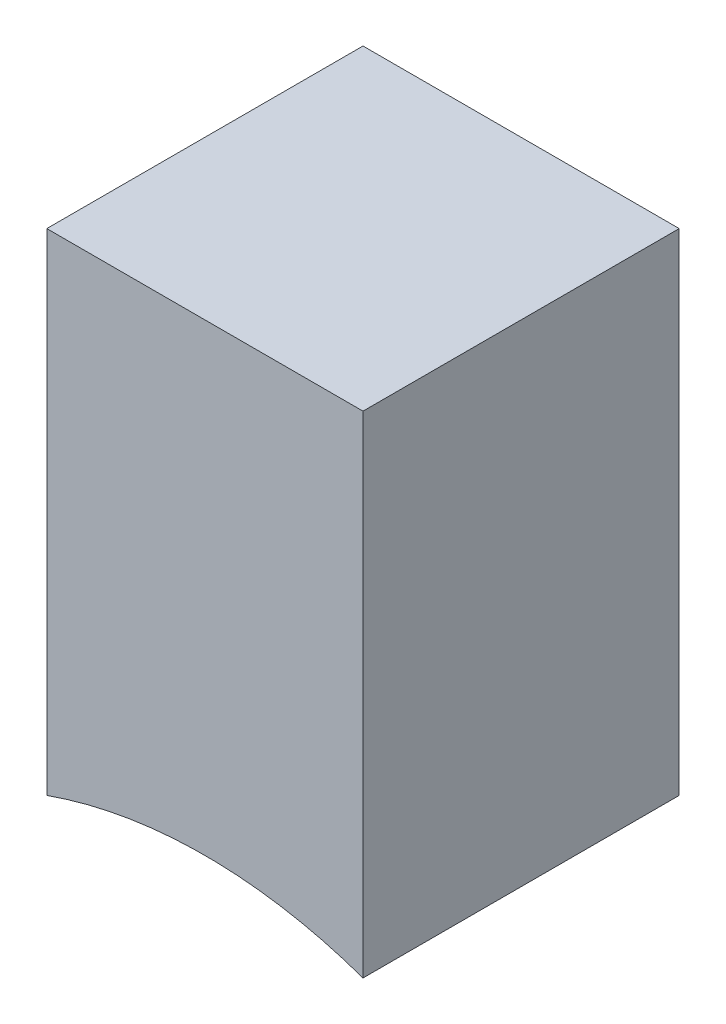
ISO-10303-21;
HEADER;
FILE_DESCRIPTION(('STEP AP214'),'2;1');
FILE_NAME('part.step','',(''),(''),'','','');
FILE_SCHEMA(('AUTOMOTIVE_DESIGN { 1 0 10303 214 1 1 1 1 }'));
ENDSEC;
DATA;
#1=APPLICATION_CONTEXT('core data for automotive mechanical design processes');
#2=APPLICATION_PROTOCOL_DEFINITION('international standard','automotive_design',2000,#1);
#3=PRODUCT_CONTEXT('',#1,'mechanical');
#4=PRODUCT('Part','Part','',(#3));
#5=PRODUCT_RELATED_PRODUCT_CATEGORY('part','',(#4));
#6=PRODUCT_DEFINITION_FORMATION('','',#4);
#7=PRODUCT_DEFINITION_CONTEXT('part definition',#1,'design');
#8=PRODUCT_DEFINITION('design','',#6,#7);
#9=PRODUCT_DEFINITION_SHAPE('','',#8);
#10=(LENGTH_UNIT() NAMED_UNIT(*) SI_UNIT(.MILLI.,.METRE.));
#11=(NAMED_UNIT(*) PLANE_ANGLE_UNIT() SI_UNIT($,.RADIAN.));
#12=(NAMED_UNIT(*) SI_UNIT($,.STERADIAN.) SOLID_ANGLE_UNIT());
#13=UNCERTAINTY_MEASURE_WITH_UNIT(LENGTH_MEASURE(1.E-05),#10,'distance_accuracy_value','');
#14=(GEOMETRIC_REPRESENTATION_CONTEXT(3) GLOBAL_UNCERTAINTY_ASSIGNED_CONTEXT((#13)) GLOBAL_UNIT_ASSIGNED_CONTEXT((#10,
#11,#12)) REPRESENTATION_CONTEXT('',''));
#15=CARTESIAN_POINT('',(0.,0.,0.));
#16=DIRECTION('',(0.,0.,1.));
#17=DIRECTION('',(1.,0.,0.));
#18=AXIS2_PLACEMENT_3D('',#15,#16,#17);
#19=CARTESIAN_POINT('',(0.,24.7771123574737,6.));
#20=DIRECTION('',(0.,0.,-1.));
#21=DIRECTION('',(-1.,0.,0.));
#22=AXIS2_PLACEMENT_3D('',#19,#20,#21);
#23=CYLINDRICAL_SURFACE('',#22,9.00000000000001);
#24=CARTESIAN_POINT('',(0.,24.7771123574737,0.));
#25=DIRECTION('',(0.,0.,-1.));
#26=DIRECTION('',(1.,0.,0.));
#27=AXIS2_PLACEMENT_3D('',#24,#25,#26);
#28=CIRCLE('',#27,9.00000000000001);
#29=CARTESIAN_POINT('',(-3.,33.2623937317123,0.));
#30=VERTEX_POINT('',#29);
#31=CARTESIAN_POINT('',(3.,33.2623937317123,0.));
#32=VERTEX_POINT('',#31);
#33=EDGE_CURVE('E73',#30,#32,#28,.T.);
#34=ORIENTED_EDGE('',*,*,#33,.T.);
#35=DIRECTION('',(0.,0.,-1.));
#36=VECTOR('',#35,1.);
#37=CARTESIAN_POINT('',(3.,33.2623937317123,6.));
#38=LINE('',#37,#36);
#39=CARTESIAN_POINT('',(3.,33.2623937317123,6.));
#40=VERTEX_POINT('',#39);
#41=EDGE_CURVE('E11',#40,#32,#38,.T.);
#42=ORIENTED_EDGE('',*,*,#41,.F.);
#43=CARTESIAN_POINT('',(0.,24.7771123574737,6.));
#44=DIRECTION('',(0.,0.,-1.));
#45=DIRECTION('',(1.,0.,0.));
#46=AXIS2_PLACEMENT_3D('',#43,#44,#45);
#47=CIRCLE('',#46,9.00000000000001);
#48=CARTESIAN_POINT('',(-3.,33.2623937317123,6.));
#49=VERTEX_POINT('',#48);
#50=EDGE_CURVE('E91',#49,#40,#47,.T.);
#51=ORIENTED_EDGE('',*,*,#50,.F.);
#52=DIRECTION('',(0.,0.,-1.));
#53=VECTOR('',#52,1.);
#54=CARTESIAN_POINT('',(-3.,33.2623937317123,6.));
#55=LINE('',#54,#53);
#56=EDGE_CURVE('E85',#49,#30,#55,.T.);
#57=ORIENTED_EDGE('',*,*,#56,.T.);
#58=EDGE_LOOP('',(#34,#42,#51,#57));
#59=FACE_BOUND('',#58,.T.);
#60=ADVANCED_FACE('F29',(#59),#23,.F.);
#61=CARTESIAN_POINT('',(3.,42.5771123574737,6.));
#62=DIRECTION('',(-1.,0.,0.));
#63=DIRECTION('',(0.,-1.,0.));
#64=AXIS2_PLACEMENT_3D('',#61,#62,#63);
#65=PLANE('',#64);
#66=DIRECTION('',(0.,1.,0.));
#67=VECTOR('',#66,1.);
#68=CARTESIAN_POINT('',(3.,42.5771123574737,0.));
#69=LINE('',#68,#67);
#70=CARTESIAN_POINT('',(3.,42.5771123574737,0.));
#71=VERTEX_POINT('',#70);
#72=EDGE_CURVE('E69',#32,#71,#69,.T.);
#73=ORIENTED_EDGE('',*,*,#72,.T.);
#74=DIRECTION('',(0.,0.,-1.));
#75=VECTOR('',#74,1.);
#76=CARTESIAN_POINT('',(3.,42.5771123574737,6.));
#77=LINE('',#76,#75);
#78=CARTESIAN_POINT('',(3.,42.5771123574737,6.));
#79=VERTEX_POINT('',#78);
#80=EDGE_CURVE('E36',#79,#71,#77,.T.);
#81=ORIENTED_EDGE('',*,*,#80,.F.);
#82=DIRECTION('',(0.,1.,0.));
#83=VECTOR('',#82,1.);
#84=CARTESIAN_POINT('',(3.,42.5771123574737,6.));
#85=LINE('',#84,#83);
#86=EDGE_CURVE('E81',#40,#79,#85,.T.);
#87=ORIENTED_EDGE('',*,*,#86,.F.);
#88=ORIENTED_EDGE('',*,*,#41,.T.);
#89=EDGE_LOOP('',(#73,#81,#87,#88));
#90=FACE_BOUND('',#89,.T.);
#91=ADVANCED_FACE('F80',(#90),#65,.F.);
#92=CARTESIAN_POINT('',(3.,42.5771123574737,6.));
#93=DIRECTION('',(0.,-1.,0.));
#94=DIRECTION('',(0.,0.,-1.));
#95=AXIS2_PLACEMENT_3D('',#92,#93,#94);
#96=PLANE('',#95);
#97=DIRECTION('',(-1.,0.,0.));
#98=VECTOR('',#97,1.);
#99=CARTESIAN_POINT('',(3.,42.5771123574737,0.));
#100=LINE('',#99,#98);
#101=CARTESIAN_POINT('',(-3.,42.5771123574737,0.));
#102=VERTEX_POINT('',#101);
#103=EDGE_CURVE('E74',#71,#102,#100,.T.);
#104=ORIENTED_EDGE('',*,*,#103,.T.);
#105=DIRECTION('',(0.,0.,-1.));
#106=VECTOR('',#105,1.);
#107=CARTESIAN_POINT('',(-3.,42.5771123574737,6.));
#108=LINE('',#107,#106);
#109=CARTESIAN_POINT('',(-3.,42.5771123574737,6.));
#110=VERTEX_POINT('',#109);
#111=EDGE_CURVE('E97',#110,#102,#108,.T.);
#112=ORIENTED_EDGE('',*,*,#111,.F.);
#113=DIRECTION('',(-1.,0.,0.));
#114=VECTOR('',#113,1.);
#115=CARTESIAN_POINT('',(3.,42.5771123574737,6.));
#116=LINE('',#115,#114);
#117=EDGE_CURVE('E48',#79,#110,#116,.T.);
#118=ORIENTED_EDGE('',*,*,#117,.F.);
#119=ORIENTED_EDGE('',*,*,#80,.T.);
#120=EDGE_LOOP('',(#104,#112,#118,#119));
#121=FACE_BOUND('',#120,.T.);
#122=ADVANCED_FACE('F100',(#121),#96,.F.);
#123=CARTESIAN_POINT('',(-3.,42.5771123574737,6.));
#124=DIRECTION('',(1.,0.,0.));
#125=DIRECTION('',(0.,1.,0.));
#126=AXIS2_PLACEMENT_3D('',#123,#124,#125);
#127=PLANE('',#126);
#128=DIRECTION('',(0.,-1.,0.));
#129=VECTOR('',#128,1.);
#130=CARTESIAN_POINT('',(-3.,42.5771123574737,0.));
#131=LINE('',#130,#129);
#132=EDGE_CURVE('E89',#102,#30,#131,.T.);
#133=ORIENTED_EDGE('',*,*,#132,.T.);
#134=ORIENTED_EDGE('',*,*,#56,.F.);
#135=DIRECTION('',(0.,-1.,0.));
#136=VECTOR('',#135,1.);
#137=CARTESIAN_POINT('',(-3.,42.5771123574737,6.));
#138=LINE('',#137,#136);
#139=EDGE_CURVE('E43',#110,#49,#138,.T.);
#140=ORIENTED_EDGE('',*,*,#139,.F.);
#141=ORIENTED_EDGE('',*,*,#111,.T.);
#142=EDGE_LOOP('',(#133,#134,#140,#141));
#143=FACE_BOUND('',#142,.T.);
#144=ADVANCED_FACE('F102',(#143),#127,.F.);
#145=CARTESIAN_POINT('',(0.,24.7771123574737,6.));
#146=DIRECTION('',(0.,0.,1.));
#147=DIRECTION('',(1.,0.,0.));
#148=AXIS2_PLACEMENT_3D('',#145,#146,#147);
#149=PLANE('',#148);
#150=ORIENTED_EDGE('',*,*,#50,.T.);
#151=ORIENTED_EDGE('',*,*,#86,.T.);
#152=ORIENTED_EDGE('',*,*,#117,.T.);
#153=ORIENTED_EDGE('',*,*,#139,.T.);
#154=EDGE_LOOP('',(#150,#151,#152,#153));
#155=FACE_BOUND('',#154,.T.);
#156=ADVANCED_FACE('F103',(#155),#149,.T.);
#157=CARTESIAN_POINT('',(0.,24.7771123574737,0.));
#158=DIRECTION('',(0.,0.,1.));
#159=DIRECTION('',(1.,0.,0.));
#160=AXIS2_PLACEMENT_3D('',#157,#158,#159);
#161=PLANE('',#160);
#162=ORIENTED_EDGE('',*,*,#33,.F.);
#163=ORIENTED_EDGE('',*,*,#132,.F.);
#164=ORIENTED_EDGE('',*,*,#103,.F.);
#165=ORIENTED_EDGE('',*,*,#72,.F.);
#166=EDGE_LOOP('',(#162,#163,#164,#165));
#167=FACE_BOUND('',#166,.T.);
#168=ADVANCED_FACE('F70',(#167),#161,.F.);
#169=CLOSED_SHELL('',(#60,#91,#122,#144,#156,#168));
#170=MANIFOLD_SOLID_BREP('B2',#169);
#171=ADVANCED_BREP_SHAPE_REPRESENTATION('',(#18,#170),#14);
#172=SHAPE_DEFINITION_REPRESENTATION(#9,#171);
ENDSEC;
END-ISO-10303-21;
